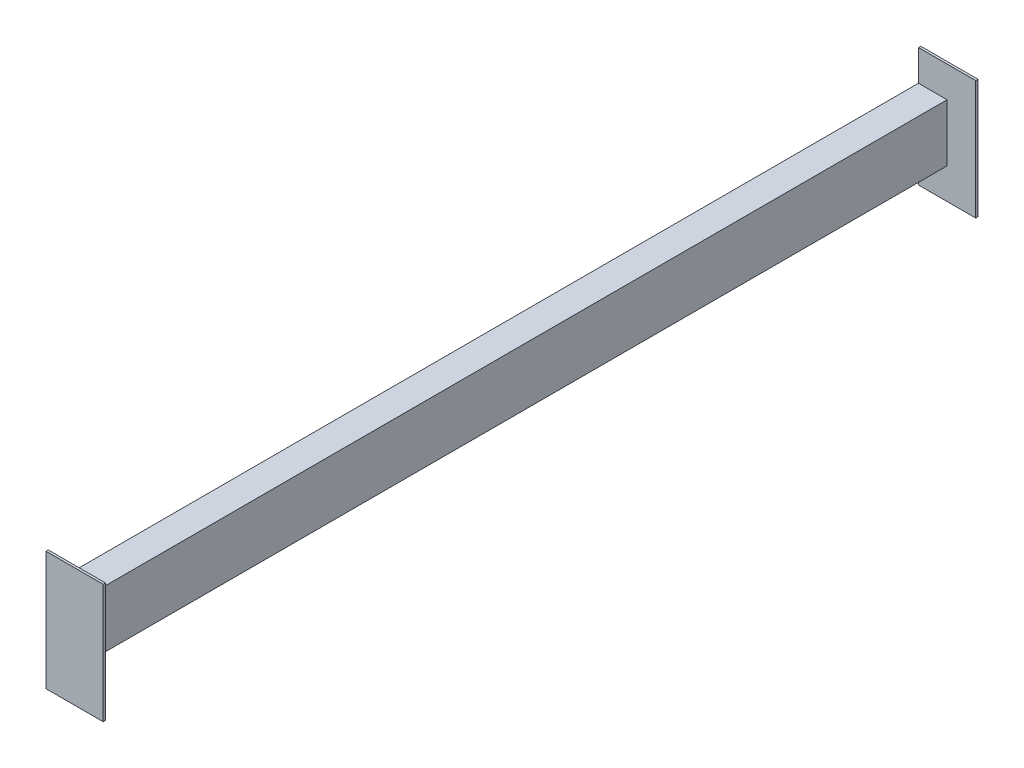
ISO-10303-21;
HEADER;
FILE_DESCRIPTION(('STEP AP214'),'2;1');
FILE_NAME('part.step','',(''),(''),'','','');
FILE_SCHEMA(('AUTOMOTIVE_DESIGN { 1 0 10303 214 1 1 1 1 }'));
ENDSEC;
DATA;
#1=APPLICATION_CONTEXT('core data for automotive mechanical design processes');
#2=APPLICATION_PROTOCOL_DEFINITION('international standard','automotive_design',2000,#1);
#3=PRODUCT_CONTEXT('',#1,'mechanical');
#4=PRODUCT('Part','Part','',(#3));
#5=PRODUCT_RELATED_PRODUCT_CATEGORY('part','',(#4));
#6=PRODUCT_DEFINITION_FORMATION('','',#4);
#7=PRODUCT_DEFINITION_CONTEXT('part definition',#1,'design');
#8=PRODUCT_DEFINITION('design','',#6,#7);
#9=PRODUCT_DEFINITION_SHAPE('','',#8);
#10=(LENGTH_UNIT() NAMED_UNIT(*) SI_UNIT(.MILLI.,.METRE.));
#11=(NAMED_UNIT(*) PLANE_ANGLE_UNIT() SI_UNIT($,.RADIAN.));
#12=(NAMED_UNIT(*) SI_UNIT($,.STERADIAN.) SOLID_ANGLE_UNIT());
#13=UNCERTAINTY_MEASURE_WITH_UNIT(LENGTH_MEASURE(1.E-05),#10,'distance_accuracy_value','');
#14=(GEOMETRIC_REPRESENTATION_CONTEXT(3) GLOBAL_UNCERTAINTY_ASSIGNED_CONTEXT((#13)) GLOBAL_UNIT_ASSIGNED_CONTEXT((#10,
#11,#12)) REPRESENTATION_CONTEXT('',''));
#15=CARTESIAN_POINT('',(0.,0.,0.));
#16=DIRECTION('',(0.,0.,1.));
#17=DIRECTION('',(1.,0.,0.));
#18=AXIS2_PLACEMENT_3D('',#15,#16,#17);
#19=CARTESIAN_POINT('',(0.,0.,760.));
#20=DIRECTION('',(1.,0.,0.));
#21=DIRECTION('',(0.,0.,-1.));
#22=AXIS2_PLACEMENT_3D('',#19,#20,#21);
#23=PLANE('',#22);
#24=DIRECTION('',(0.,0.,-1.));
#25=VECTOR('',#24,1.);
#26=CARTESIAN_POINT('',(0.,50.,760.));
#27=LINE('',#26,#25);
#28=CARTESIAN_POINT('',(0.,50.,760.));
#29=VERTEX_POINT('',#28);
#30=CARTESIAN_POINT('',(0.,50.,0.));
#31=VERTEX_POINT('',#30);
#32=EDGE_CURVE('E254',#29,#31,#27,.T.);
#33=ORIENTED_EDGE('',*,*,#32,.T.);
#34=DIRECTION('',(0.,1.,0.));
#35=VECTOR('',#34,1.);
#36=CARTESIAN_POINT('',(0.,77.,0.));
#37=LINE('',#36,#35);
#38=CARTESIAN_POINT('',(0.,77.,0.));
#39=VERTEX_POINT('',#38);
#40=EDGE_CURVE('E209',#31,#39,#37,.T.);
#41=ORIENTED_EDGE('',*,*,#40,.T.);
#42=DIRECTION('',(0.,0.,1.));
#43=VECTOR('',#42,1.);
#44=CARTESIAN_POINT('',(0.,77.,-2.));
#45=LINE('',#44,#43);
#46=CARTESIAN_POINT('',(0.,77.,-2.));
#47=VERTEX_POINT('',#46);
#48=EDGE_CURVE('E201',#47,#39,#45,.T.);
#49=ORIENTED_EDGE('',*,*,#48,.F.);
#50=DIRECTION('',(0.,1.,0.));
#51=VECTOR('',#50,1.);
#52=CARTESIAN_POINT('',(0.,77.,-2.));
#53=LINE('',#52,#51);
#54=CARTESIAN_POINT('',(0.,-27.,-2.));
#55=VERTEX_POINT('',#54);
#56=EDGE_CURVE('E182',#55,#47,#53,.T.);
#57=ORIENTED_EDGE('',*,*,#56,.F.);
#58=DIRECTION('',(0.,0.,1.));
#59=VECTOR('',#58,1.);
#60=CARTESIAN_POINT('',(0.,-27.,-2.));
#61=LINE('',#60,#59);
#62=CARTESIAN_POINT('',(0.,-27.,0.));
#63=VERTEX_POINT('',#62);
#64=EDGE_CURVE('E179',#55,#63,#61,.T.);
#65=ORIENTED_EDGE('',*,*,#64,.T.);
#66=CARTESIAN_POINT('',(0.,0.,0.));
#67=VERTEX_POINT('',#66);
#68=EDGE_CURVE('E205',#63,#67,#37,.T.);
#69=ORIENTED_EDGE('',*,*,#68,.T.);
#70=DIRECTION('',(0.,0.,-1.));
#71=VECTOR('',#70,1.);
#72=CARTESIAN_POINT('',(0.,0.,760.));
#73=LINE('',#72,#71);
#74=CARTESIAN_POINT('',(0.,0.,760.));
#75=VERTEX_POINT('',#74);
#76=EDGE_CURVE('E11',#75,#67,#73,.T.);
#77=ORIENTED_EDGE('',*,*,#76,.F.);
#78=DIRECTION('',(0.,-1.,0.));
#79=VECTOR('',#78,1.);
#80=CARTESIAN_POINT('',(0.,77.,760.));
#81=LINE('',#80,#79);
#82=CARTESIAN_POINT('',(0.,-27.,760.));
#83=VERTEX_POINT('',#82);
#84=EDGE_CURVE('E197',#75,#83,#81,.T.);
#85=ORIENTED_EDGE('',*,*,#84,.T.);
#86=DIRECTION('',(0.,0.,-1.));
#87=VECTOR('',#86,1.);
#88=CARTESIAN_POINT('',(0.,-27.,762.));
#89=LINE('',#88,#87);
#90=CARTESIAN_POINT('',(0.,-27.,762.));
#91=VERTEX_POINT('',#90);
#92=EDGE_CURVE('E284',#91,#83,#89,.T.);
#93=ORIENTED_EDGE('',*,*,#92,.F.);
#94=DIRECTION('',(0.,-1.,0.));
#95=VECTOR('',#94,1.);
#96=CARTESIAN_POINT('',(0.,77.,762.));
#97=LINE('',#96,#95);
#98=CARTESIAN_POINT('',(0.,77.,762.));
#99=VERTEX_POINT('',#98);
#100=EDGE_CURVE('E307',#99,#91,#97,.T.);
#101=ORIENTED_EDGE('',*,*,#100,.F.);
#102=DIRECTION('',(0.,0.,-1.));
#103=VECTOR('',#102,1.);
#104=CARTESIAN_POINT('',(0.,77.,762.));
#105=LINE('',#104,#103);
#106=CARTESIAN_POINT('',(0.,77.,760.));
#107=VERTEX_POINT('',#106);
#108=EDGE_CURVE('E308',#99,#107,#105,.T.);
#109=ORIENTED_EDGE('',*,*,#108,.T.);
#110=EDGE_CURVE('E199',#107,#29,#81,.T.);
#111=ORIENTED_EDGE('',*,*,#110,.T.);
#112=EDGE_LOOP('',(#33,#41,#49,#57,#65,#69,#77,#85,#93,#101,#109,#111));
#113=FACE_BOUND('',#112,.T.);
#114=ADVANCED_FACE('F36',(#113),#23,.F.);
#115=CARTESIAN_POINT('',(0.,0.,760.));
#116=DIRECTION('',(0.,1.,0.));
#117=DIRECTION('',(0.,0.,1.));
#118=AXIS2_PLACEMENT_3D('',#115,#116,#117);
#119=PLANE('',#118);
#120=DIRECTION('',(1.,0.,0.));
#121=VECTOR('',#120,1.);
#122=CARTESIAN_POINT('',(0.,0.,0.));
#123=LINE('',#122,#121);
#124=CARTESIAN_POINT('',(25.,0.,0.));
#125=VERTEX_POINT('',#124);
#126=EDGE_CURVE('E232',#67,#125,#123,.T.);
#127=ORIENTED_EDGE('',*,*,#126,.T.);
#128=DIRECTION('',(0.,0.,-1.));
#129=VECTOR('',#128,1.);
#130=CARTESIAN_POINT('',(25.,0.,760.));
#131=LINE('',#130,#129);
#132=CARTESIAN_POINT('',(25.,0.,760.));
#133=VERTEX_POINT('',#132);
#134=EDGE_CURVE('E46',#133,#125,#131,.T.);
#135=ORIENTED_EDGE('',*,*,#134,.F.);
#136=DIRECTION('',(1.,0.,0.));
#137=VECTOR('',#136,1.);
#138=CARTESIAN_POINT('',(0.,0.,760.));
#139=LINE('',#138,#137);
#140=EDGE_CURVE('E246',#75,#133,#139,.T.);
#141=ORIENTED_EDGE('',*,*,#140,.F.);
#142=ORIENTED_EDGE('',*,*,#76,.T.);
#143=EDGE_LOOP('',(#127,#135,#141,#142));
#144=FACE_BOUND('',#143,.T.);
#145=ADVANCED_FACE('F273',(#144),#119,.F.);
#146=CARTESIAN_POINT('',(25.,0.,760.));
#147=DIRECTION('',(-1.,0.,0.));
#148=DIRECTION('',(0.,-1.,0.));
#149=AXIS2_PLACEMENT_3D('',#146,#147,#148);
#150=PLANE('',#149);
#151=DIRECTION('',(0.,1.,0.));
#152=VECTOR('',#151,1.);
#153=CARTESIAN_POINT('',(25.,0.,0.));
#154=LINE('',#153,#152);
#155=CARTESIAN_POINT('',(25.,50.,0.));
#156=VERTEX_POINT('',#155);
#157=EDGE_CURVE('E75',#125,#156,#154,.T.);
#158=ORIENTED_EDGE('',*,*,#157,.T.);
#159=DIRECTION('',(0.,0.,-1.));
#160=VECTOR('',#159,1.);
#161=CARTESIAN_POINT('',(25.,50.,760.));
#162=LINE('',#161,#160);
#163=CARTESIAN_POINT('',(25.,50.,760.));
#164=VERTEX_POINT('',#163);
#165=EDGE_CURVE('E63',#164,#156,#162,.T.);
#166=ORIENTED_EDGE('',*,*,#165,.F.);
#167=DIRECTION('',(0.,1.,0.));
#168=VECTOR('',#167,1.);
#169=CARTESIAN_POINT('',(25.,0.,760.));
#170=LINE('',#169,#168);
#171=EDGE_CURVE('E249',#133,#164,#170,.T.);
#172=ORIENTED_EDGE('',*,*,#171,.F.);
#173=ORIENTED_EDGE('',*,*,#134,.T.);
#174=EDGE_LOOP('',(#158,#166,#172,#173));
#175=FACE_BOUND('',#174,.T.);
#176=ADVANCED_FACE('F272',(#175),#150,.F.);
#177=CARTESIAN_POINT('',(0.,50.,760.));
#178=DIRECTION('',(0.,-1.,0.));
#179=DIRECTION('',(0.,0.,-1.));
#180=AXIS2_PLACEMENT_3D('',#177,#178,#179);
#181=PLANE('',#180);
#182=DIRECTION('',(-1.,0.,0.));
#183=VECTOR('',#182,1.);
#184=CARTESIAN_POINT('',(0.,50.,0.));
#185=LINE('',#184,#183);
#186=EDGE_CURVE('E39',#156,#31,#185,.T.);
#187=ORIENTED_EDGE('',*,*,#186,.T.);
#188=ORIENTED_EDGE('',*,*,#32,.F.);
#189=DIRECTION('',(-1.,0.,0.));
#190=VECTOR('',#189,1.);
#191=CARTESIAN_POINT('',(0.,50.,760.));
#192=LINE('',#191,#190);
#193=EDGE_CURVE('E250',#164,#29,#192,.T.);
#194=ORIENTED_EDGE('',*,*,#193,.F.);
#195=ORIENTED_EDGE('',*,*,#165,.T.);
#196=EDGE_LOOP('',(#187,#188,#194,#195));
#197=FACE_BOUND('',#196,.T.);
#198=ADVANCED_FACE('F266',(#197),#181,.F.);
#199=CARTESIAN_POINT('',(0.,-27.,760.));
#200=DIRECTION('',(0.,0.,1.));
#201=DIRECTION('',(1.,0.,0.));
#202=AXIS2_PLACEMENT_3D('',#199,#200,#201);
#203=PLANE('',#202);
#204=ORIENTED_EDGE('',*,*,#84,.F.);
#205=ORIENTED_EDGE('',*,*,#140,.T.);
#206=ORIENTED_EDGE('',*,*,#171,.T.);
#207=ORIENTED_EDGE('',*,*,#193,.T.);
#208=ORIENTED_EDGE('',*,*,#110,.F.);
#209=DIRECTION('',(-1.,0.,0.));
#210=VECTOR('',#209,1.);
#211=CARTESIAN_POINT('',(0.,77.,760.));
#212=LINE('',#211,#210);
#213=CARTESIAN_POINT('',(50.,77.,760.));
#214=VERTEX_POINT('',#213);
#215=EDGE_CURVE('E305',#214,#107,#212,.T.);
#216=ORIENTED_EDGE('',*,*,#215,.F.);
#217=DIRECTION('',(0.,1.,0.));
#218=VECTOR('',#217,1.);
#219=CARTESIAN_POINT('',(50.,77.,760.));
#220=LINE('',#219,#218);
#221=CARTESIAN_POINT('',(50.,-27.,760.));
#222=VERTEX_POINT('',#221);
#223=EDGE_CURVE('E279',#222,#214,#220,.T.);
#224=ORIENTED_EDGE('',*,*,#223,.F.);
#225=DIRECTION('',(1.,0.,0.));
#226=VECTOR('',#225,1.);
#227=CARTESIAN_POINT('',(0.,-27.,760.));
#228=LINE('',#227,#226);
#229=EDGE_CURVE('E277',#83,#222,#228,.T.);
#230=ORIENTED_EDGE('',*,*,#229,.F.);
#231=EDGE_LOOP('',(#204,#205,#206,#207,#208,#216,#224,#230));
#232=FACE_BOUND('',#231,.T.);
#233=ADVANCED_FACE('F270',(#232),#203,.F.);
#234=CARTESIAN_POINT('',(0.,-27.,762.));
#235=DIRECTION('',(0.,1.,0.));
#236=DIRECTION('',(0.,0.,1.));
#237=AXIS2_PLACEMENT_3D('',#234,#235,#236);
#238=PLANE('',#237);
#239=ORIENTED_EDGE('',*,*,#229,.T.);
#240=DIRECTION('',(0.,0.,-1.));
#241=VECTOR('',#240,1.);
#242=CARTESIAN_POINT('',(50.,-27.,762.));
#243=LINE('',#242,#241);
#244=CARTESIAN_POINT('',(50.,-27.,762.));
#245=VERTEX_POINT('',#244);
#246=EDGE_CURVE('E289',#245,#222,#243,.T.);
#247=ORIENTED_EDGE('',*,*,#246,.F.);
#248=DIRECTION('',(1.,0.,0.));
#249=VECTOR('',#248,1.);
#250=CARTESIAN_POINT('',(0.,-27.,762.));
#251=LINE('',#250,#249);
#252=EDGE_CURVE('E286',#91,#245,#251,.T.);
#253=ORIENTED_EDGE('',*,*,#252,.F.);
#254=ORIENTED_EDGE('',*,*,#92,.T.);
#255=EDGE_LOOP('',(#239,#247,#253,#254));
#256=FACE_BOUND('',#255,.T.);
#257=ADVANCED_FACE('F285',(#256),#238,.F.);
#258=CARTESIAN_POINT('',(50.,77.,762.));
#259=DIRECTION('',(-1.,0.,0.));
#260=DIRECTION('',(0.,-1.,0.));
#261=AXIS2_PLACEMENT_3D('',#258,#259,#260);
#262=PLANE('',#261);
#263=ORIENTED_EDGE('',*,*,#223,.T.);
#264=DIRECTION('',(0.,0.,-1.));
#265=VECTOR('',#264,1.);
#266=CARTESIAN_POINT('',(50.,77.,762.));
#267=LINE('',#266,#265);
#268=CARTESIAN_POINT('',(50.,77.,762.));
#269=VERTEX_POINT('',#268);
#270=EDGE_CURVE('E292',#269,#214,#267,.T.);
#271=ORIENTED_EDGE('',*,*,#270,.F.);
#272=DIRECTION('',(0.,1.,0.));
#273=VECTOR('',#272,1.);
#274=CARTESIAN_POINT('',(50.,77.,762.));
#275=LINE('',#274,#273);
#276=EDGE_CURVE('E318',#245,#269,#275,.T.);
#277=ORIENTED_EDGE('',*,*,#276,.F.);
#278=ORIENTED_EDGE('',*,*,#246,.T.);
#279=EDGE_LOOP('',(#263,#271,#277,#278));
#280=FACE_BOUND('',#279,.T.);
#281=ADVANCED_FACE('F317',(#280),#262,.F.);
#282=CARTESIAN_POINT('',(0.,77.,762.));
#283=DIRECTION('',(0.,-1.,0.));
#284=DIRECTION('',(0.,0.,-1.));
#285=AXIS2_PLACEMENT_3D('',#282,#283,#284);
#286=PLANE('',#285);
#287=ORIENTED_EDGE('',*,*,#215,.T.);
#288=ORIENTED_EDGE('',*,*,#108,.F.);
#289=DIRECTION('',(-1.,0.,0.));
#290=VECTOR('',#289,1.);
#291=CARTESIAN_POINT('',(0.,77.,762.));
#292=LINE('',#291,#290);
#293=EDGE_CURVE('E300',#269,#99,#292,.T.);
#294=ORIENTED_EDGE('',*,*,#293,.F.);
#295=ORIENTED_EDGE('',*,*,#270,.T.);
#296=EDGE_LOOP('',(#287,#288,#294,#295));
#297=FACE_BOUND('',#296,.T.);
#298=ADVANCED_FACE('F313',(#297),#286,.F.);
#299=CARTESIAN_POINT('',(0.,-27.,762.));
#300=DIRECTION('',(0.,0.,1.));
#301=DIRECTION('',(1.,0.,0.));
#302=AXIS2_PLACEMENT_3D('',#299,#300,#301);
#303=PLANE('',#302);
#304=ORIENTED_EDGE('',*,*,#100,.T.);
#305=ORIENTED_EDGE('',*,*,#252,.T.);
#306=ORIENTED_EDGE('',*,*,#276,.T.);
#307=ORIENTED_EDGE('',*,*,#293,.T.);
#308=EDGE_LOOP('',(#304,#305,#306,#307));
#309=FACE_BOUND('',#308,.T.);
#310=ADVANCED_FACE('F321',(#309),#303,.T.);
#311=CARTESIAN_POINT('',(50.,77.,-2.));
#312=DIRECTION('',(-1.,0.,0.));
#313=DIRECTION('',(0.,0.,1.));
#314=AXIS2_PLACEMENT_3D('',#311,#312,#313);
#315=PLANE('',#314);
#316=DIRECTION('',(0.,-1.,0.));
#317=VECTOR('',#316,1.);
#318=CARTESIAN_POINT('',(50.,77.,0.));
#319=LINE('',#318,#317);
#320=CARTESIAN_POINT('',(50.,77.,0.));
#321=VERTEX_POINT('',#320);
#322=CARTESIAN_POINT('',(50.,-27.,0.));
#323=VERTEX_POINT('',#322);
#324=EDGE_CURVE('E196',#321,#323,#319,.T.);
#325=ORIENTED_EDGE('',*,*,#324,.T.);
#326=DIRECTION('',(0.,0.,1.));
#327=VECTOR('',#326,1.);
#328=CARTESIAN_POINT('',(50.,-27.,-2.));
#329=LINE('',#328,#327);
#330=CARTESIAN_POINT('',(50.,-27.,-2.));
#331=VERTEX_POINT('',#330);
#332=EDGE_CURVE('E176',#331,#323,#329,.T.);
#333=ORIENTED_EDGE('',*,*,#332,.F.);
#334=DIRECTION('',(0.,-1.,0.));
#335=VECTOR('',#334,1.);
#336=CARTESIAN_POINT('',(50.,77.,-2.));
#337=LINE('',#336,#335);
#338=CARTESIAN_POINT('',(50.,77.,-2.));
#339=VERTEX_POINT('',#338);
#340=EDGE_CURVE('E183',#339,#331,#337,.T.);
#341=ORIENTED_EDGE('',*,*,#340,.F.);
#342=DIRECTION('',(0.,0.,1.));
#343=VECTOR('',#342,1.);
#344=CARTESIAN_POINT('',(50.,77.,-2.));
#345=LINE('',#344,#343);
#346=EDGE_CURVE('E218',#339,#321,#345,.T.);
#347=ORIENTED_EDGE('',*,*,#346,.T.);
#348=EDGE_LOOP('',(#325,#333,#341,#347));
#349=FACE_BOUND('',#348,.T.);
#350=ADVANCED_FACE('F194',(#349),#315,.F.);
#351=CARTESIAN_POINT('',(50.,-27.,-2.));
#352=DIRECTION('',(0.,1.,0.));
#353=DIRECTION('',(0.,0.,1.));
#354=AXIS2_PLACEMENT_3D('',#351,#352,#353);
#355=PLANE('',#354);
#356=DIRECTION('',(-1.,0.,0.));
#357=VECTOR('',#356,1.);
#358=CARTESIAN_POINT('',(50.,-27.,0.));
#359=LINE('',#358,#357);
#360=EDGE_CURVE('E214',#323,#63,#359,.T.);
#361=ORIENTED_EDGE('',*,*,#360,.T.);
#362=ORIENTED_EDGE('',*,*,#64,.F.);
#363=DIRECTION('',(-1.,0.,0.));
#364=VECTOR('',#363,1.);
#365=CARTESIAN_POINT('',(50.,-27.,-2.));
#366=LINE('',#365,#364);
#367=EDGE_CURVE('E172',#331,#55,#366,.T.);
#368=ORIENTED_EDGE('',*,*,#367,.F.);
#369=ORIENTED_EDGE('',*,*,#332,.T.);
#370=EDGE_LOOP('',(#361,#362,#368,#369));
#371=FACE_BOUND('',#370,.T.);
#372=ADVANCED_FACE('F174',(#371),#355,.F.);
#373=CARTESIAN_POINT('',(50.,77.,-2.));
#374=DIRECTION('',(0.,-1.,0.));
#375=DIRECTION('',(0.,0.,-1.));
#376=AXIS2_PLACEMENT_3D('',#373,#374,#375);
#377=PLANE('',#376);
#378=DIRECTION('',(1.,0.,0.));
#379=VECTOR('',#378,1.);
#380=CARTESIAN_POINT('',(50.,77.,0.));
#381=LINE('',#380,#379);
#382=EDGE_CURVE('E192',#39,#321,#381,.T.);
#383=ORIENTED_EDGE('',*,*,#382,.T.);
#384=ORIENTED_EDGE('',*,*,#346,.F.);
#385=DIRECTION('',(1.,0.,0.));
#386=VECTOR('',#385,1.);
#387=CARTESIAN_POINT('',(50.,77.,-2.));
#388=LINE('',#387,#386);
#389=EDGE_CURVE('E188',#47,#339,#388,.T.);
#390=ORIENTED_EDGE('',*,*,#389,.F.);
#391=ORIENTED_EDGE('',*,*,#48,.T.);
#392=EDGE_LOOP('',(#383,#384,#390,#391));
#393=FACE_BOUND('',#392,.T.);
#394=ADVANCED_FACE('F223',(#393),#377,.F.);
#395=CARTESIAN_POINT('',(50.,-27.,-2.));
#396=DIRECTION('',(0.,0.,-1.));
#397=DIRECTION('',(-1.,0.,0.));
#398=AXIS2_PLACEMENT_3D('',#395,#396,#397);
#399=PLANE('',#398);
#400=ORIENTED_EDGE('',*,*,#340,.T.);
#401=ORIENTED_EDGE('',*,*,#367,.T.);
#402=ORIENTED_EDGE('',*,*,#56,.T.);
#403=ORIENTED_EDGE('',*,*,#389,.T.);
#404=EDGE_LOOP('',(#400,#401,#402,#403));
#405=FACE_BOUND('',#404,.T.);
#406=ADVANCED_FACE('F186',(#405),#399,.T.);
#407=CARTESIAN_POINT('',(50.,-27.,0.));
#408=DIRECTION('',(0.,0.,-1.));
#409=DIRECTION('',(-1.,0.,0.));
#410=AXIS2_PLACEMENT_3D('',#407,#408,#409);
#411=PLANE('',#410);
#412=ORIENTED_EDGE('',*,*,#186,.F.);
#413=ORIENTED_EDGE('',*,*,#157,.F.);
#414=ORIENTED_EDGE('',*,*,#126,.F.);
#415=ORIENTED_EDGE('',*,*,#68,.F.);
#416=ORIENTED_EDGE('',*,*,#360,.F.);
#417=ORIENTED_EDGE('',*,*,#324,.F.);
#418=ORIENTED_EDGE('',*,*,#382,.F.);
#419=ORIENTED_EDGE('',*,*,#40,.F.);
#420=EDGE_LOOP('',(#412,#413,#414,#415,#416,#417,#418,#419));
#421=FACE_BOUND('',#420,.T.);
#422=ADVANCED_FACE('F225',(#421),#411,.F.);
#423=CLOSED_SHELL('',(#114,#145,#176,#198,#233,#257,#281,#298,#310,#350,#372,#394,#406,#422));
#424=DIRECTION('',(-1.,0.,0.));
#425=VECTOR('',#424,1.);
#426=CARTESIAN_POINT('',(2.,48.,0.));
#427=LINE('',#426,#425);
#428=CARTESIAN_POINT('',(23.,48.,0.));
#429=VERTEX_POINT('',#428);
#430=CARTESIAN_POINT('',(2.,48.,0.));
#431=VERTEX_POINT('',#430);
#432=EDGE_CURVE('E497',#429,#431,#427,.T.);
#433=ORIENTED_EDGE('',*,*,#432,.T.);
#434=DIRECTION('',(0.,-1.,0.));
#435=VECTOR('',#434,1.);
#436=CARTESIAN_POINT('',(2.,2.,0.));
#437=LINE('',#436,#435);
#438=CARTESIAN_POINT('',(2.,2.,0.));
#439=VERTEX_POINT('',#438);
#440=EDGE_CURVE('E498',#431,#439,#437,.T.);
#441=ORIENTED_EDGE('',*,*,#440,.T.);
#442=DIRECTION('',(1.,0.,0.));
#443=VECTOR('',#442,1.);
#444=CARTESIAN_POINT('',(2.,2.,0.));
#445=LINE('',#444,#443);
#446=CARTESIAN_POINT('',(23.,2.,0.));
#447=VERTEX_POINT('',#446);
#448=EDGE_CURVE('E54',#439,#447,#445,.T.);
#449=ORIENTED_EDGE('',*,*,#448,.T.);
#450=DIRECTION('',(0.,1.,0.));
#451=VECTOR('',#450,1.);
#452=CARTESIAN_POINT('',(23.,2.,0.));
#453=LINE('',#452,#451);
#454=EDGE_CURVE('E98',#447,#429,#453,.T.);
#455=ORIENTED_EDGE('',*,*,#454,.T.);
#456=EDGE_LOOP('',(#433,#441,#449,#455));
#457=FACE_BOUND('',#456,.T.);
#458=ADVANCED_FACE('F362',(#457),#411,.F.);
#459=DIRECTION('',(1.,0.,0.));
#460=VECTOR('',#459,1.);
#461=CARTESIAN_POINT('',(2.,2.,760.));
#462=LINE('',#461,#460);
#463=CARTESIAN_POINT('',(2.,2.,760.));
#464=VERTEX_POINT('',#463);
#465=CARTESIAN_POINT('',(23.,2.,760.));
#466=VERTEX_POINT('',#465);
#467=EDGE_CURVE('E102',#464,#466,#462,.T.);
#468=ORIENTED_EDGE('',*,*,#467,.F.);
#469=DIRECTION('',(0.,-1.,0.));
#470=VECTOR('',#469,1.);
#471=CARTESIAN_POINT('',(2.,2.,760.));
#472=LINE('',#471,#470);
#473=CARTESIAN_POINT('',(2.,48.,760.));
#474=VERTEX_POINT('',#473);
#475=EDGE_CURVE('E105',#474,#464,#472,.T.);
#476=ORIENTED_EDGE('',*,*,#475,.F.);
#477=DIRECTION('',(-1.,0.,0.));
#478=VECTOR('',#477,1.);
#479=CARTESIAN_POINT('',(2.,48.,760.));
#480=LINE('',#479,#478);
#481=CARTESIAN_POINT('',(23.,48.,760.));
#482=VERTEX_POINT('',#481);
#483=EDGE_CURVE('E85',#482,#474,#480,.T.);
#484=ORIENTED_EDGE('',*,*,#483,.F.);
#485=DIRECTION('',(0.,1.,0.));
#486=VECTOR('',#485,1.);
#487=CARTESIAN_POINT('',(23.,2.,760.));
#488=LINE('',#487,#486);
#489=EDGE_CURVE('E509',#466,#482,#488,.T.);
#490=ORIENTED_EDGE('',*,*,#489,.F.);
#491=EDGE_LOOP('',(#468,#476,#484,#490));
#492=FACE_BOUND('',#491,.T.);
#493=ADVANCED_FACE('F353',(#492),#203,.F.);
#494=CARTESIAN_POINT('',(2.,48.,760.));
#495=DIRECTION('',(0.,-1.,0.));
#496=DIRECTION('',(0.,0.,-1.));
#497=AXIS2_PLACEMENT_3D('',#494,#495,#496);
#498=PLANE('',#497);
#499=ORIENTED_EDGE('',*,*,#432,.F.);
#500=DIRECTION('',(0.,0.,-1.));
#501=VECTOR('',#500,1.);
#502=CARTESIAN_POINT('',(23.,48.,760.));
#503=LINE('',#502,#501);
#504=EDGE_CURVE('E238',#482,#429,#503,.T.);
#505=ORIENTED_EDGE('',*,*,#504,.F.);
#506=ORIENTED_EDGE('',*,*,#483,.T.);
#507=DIRECTION('',(0.,0.,-1.));
#508=VECTOR('',#507,1.);
#509=CARTESIAN_POINT('',(2.,48.,760.));
#510=LINE('',#509,#508);
#511=EDGE_CURVE('E507',#474,#431,#510,.T.);
#512=ORIENTED_EDGE('',*,*,#511,.T.);
#513=EDGE_LOOP('',(#499,#505,#506,#512));
#514=FACE_BOUND('',#513,.T.);
#515=ADVANCED_FACE('F350',(#514),#498,.T.);
#516=CARTESIAN_POINT('',(23.,2.,760.));
#517=DIRECTION('',(-1.,0.,0.));
#518=DIRECTION('',(0.,0.,1.));
#519=AXIS2_PLACEMENT_3D('',#516,#517,#518);
#520=PLANE('',#519);
#521=ORIENTED_EDGE('',*,*,#454,.F.);
#522=DIRECTION('',(0.,0.,-1.));
#523=VECTOR('',#522,1.);
#524=CARTESIAN_POINT('',(23.,2.,760.));
#525=LINE('',#524,#523);
#526=EDGE_CURVE('E235',#466,#447,#525,.T.);
#527=ORIENTED_EDGE('',*,*,#526,.F.);
#528=ORIENTED_EDGE('',*,*,#489,.T.);
#529=ORIENTED_EDGE('',*,*,#504,.T.);
#530=EDGE_LOOP('',(#521,#527,#528,#529));
#531=FACE_BOUND('',#530,.T.);
#532=ADVANCED_FACE('F346',(#531),#520,.T.);
#533=CARTESIAN_POINT('',(2.,2.,760.));
#534=DIRECTION('',(0.,1.,0.));
#535=DIRECTION('',(0.,0.,1.));
#536=AXIS2_PLACEMENT_3D('',#533,#534,#535);
#537=PLANE('',#536);
#538=ORIENTED_EDGE('',*,*,#448,.F.);
#539=DIRECTION('',(0.,0.,-1.));
#540=VECTOR('',#539,1.);
#541=CARTESIAN_POINT('',(2.,2.,760.));
#542=LINE('',#541,#540);
#543=EDGE_CURVE('E505',#464,#439,#542,.T.);
#544=ORIENTED_EDGE('',*,*,#543,.F.);
#545=ORIENTED_EDGE('',*,*,#467,.T.);
#546=ORIENTED_EDGE('',*,*,#526,.T.);
#547=EDGE_LOOP('',(#538,#544,#545,#546));
#548=FACE_BOUND('',#547,.T.);
#549=ADVANCED_FACE('F342',(#548),#537,.T.);
#550=CARTESIAN_POINT('',(2.,2.,760.));
#551=DIRECTION('',(1.,0.,0.));
#552=DIRECTION('',(0.,0.,-1.));
#553=AXIS2_PLACEMENT_3D('',#550,#551,#552);
#554=PLANE('',#553);
#555=ORIENTED_EDGE('',*,*,#440,.F.);
#556=ORIENTED_EDGE('',*,*,#511,.F.);
#557=ORIENTED_EDGE('',*,*,#475,.T.);
#558=ORIENTED_EDGE('',*,*,#543,.T.);
#559=EDGE_LOOP('',(#555,#556,#557,#558));
#560=FACE_BOUND('',#559,.T.);
#561=ADVANCED_FACE('F345',(#560),#554,.T.);
#562=CLOSED_SHELL('',(#458,#493,#515,#532,#549,#561));
#563=ORIENTED_CLOSED_SHELL('',*,#562,.T.);
#564=BREP_WITH_VOIDS('B2',#423,(#563));
#565=ADVANCED_BREP_SHAPE_REPRESENTATION('',(#18,#564),#14);
#566=SHAPE_DEFINITION_REPRESENTATION(#9,#565);
ENDSEC;
END-ISO-10303-21;
